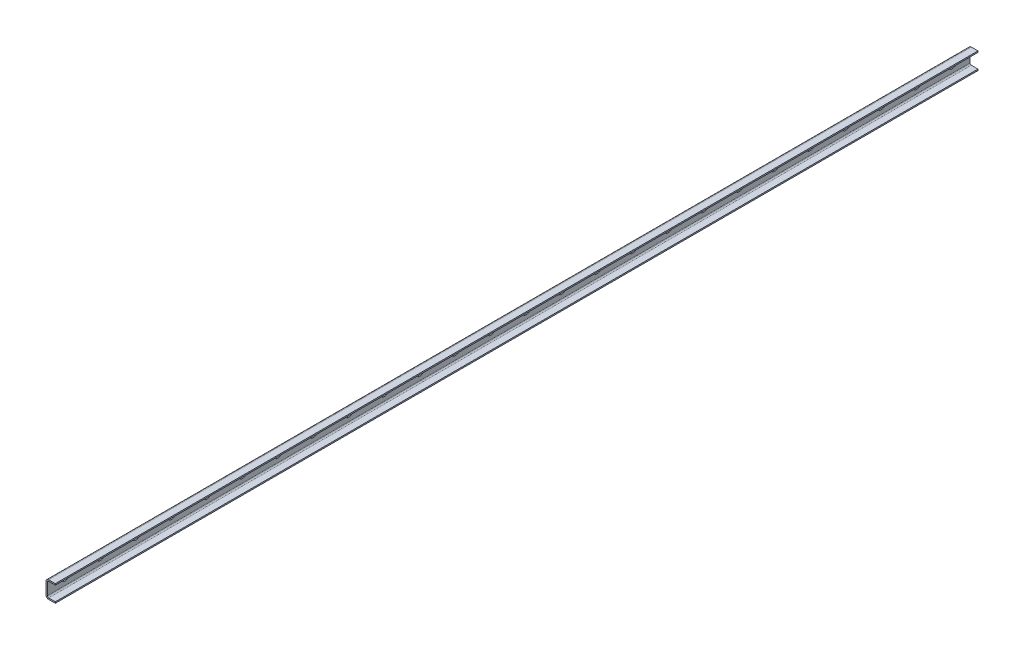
from build123d import *

# Parameters (mm, degrees)
BOSS_EXTRUDE1_DEPTH = 2080
CUT_EXTRUDE1_DEPTH  = 2081.166955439
LPATTERN1_COUNT     = 26
LPATTERN1_PITCH     = 80


with BuildPart() as part:
    # Sketch1 → Boss-Extrude1 (new body)
    with BuildSketch(Plane.XY):
        with BuildLine():
            Line((21, 16.25), (21, 19.25))
            Line((21, 19.25), (6, 19.25))
            ThreePointArc((6, 19.25), (1.757359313, 17.492640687), (0, 13.25))
            Line((0, 13.25), (0, 0))
            Line((0, 0), (0, -13.25))
            ThreePointArc((0, -13.25), (1.757359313, -17.492640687), (6, -19.25))
            Line((6, -19.25), (21, -19.25))
            Line((21, -19.25), (21, -16.25))
            Line((21, -16.25), (6, -16.25))
            ThreePointArc((6, -16.25), (3.878679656, -15.371320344), (3, -13.25))
            Line((3, -13.25), (3, 13.25))
            ThreePointArc((3, 13.25), (3.878679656, 15.371320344), (6, 16.25))
            Line((6, 16.25), (21, 16.25))
        make_face()
    extrude(amount=-BOSS_EXTRUDE1_DEPTH)

    # Sketch2 → Cut-Extrude1 (cut, through all)
    with BuildSketch(Plane(origin=(3, 0, 0), x_dir=(0, 0, -1), z_dir=(1, 0, 0))):
        with BuildLine():
            Line((38, 4.5), (42, 4.5))
            ThreePointArc((42, 4.5), (46.5, 0), (42, -4.5))
            Line((42, -4.5), (38, -4.5))
            ThreePointArc((38, -4.5), (33.5, 0), (38, 4.5))
        make_face()
    cut_extrude1 = extrude(amount=-CUT_EXTRUDE1_DEPTH, mode=Mode.SUBTRACT)

    # LPattern1: Cut-Extrude1 ×26
    with Locations(*[(0, 0, -i * LPATTERN1_PITCH) for i in range(1, LPATTERN1_COUNT)]):
        add(cut_extrude1, mode=Mode.SUBTRACT)


solid = part.part
